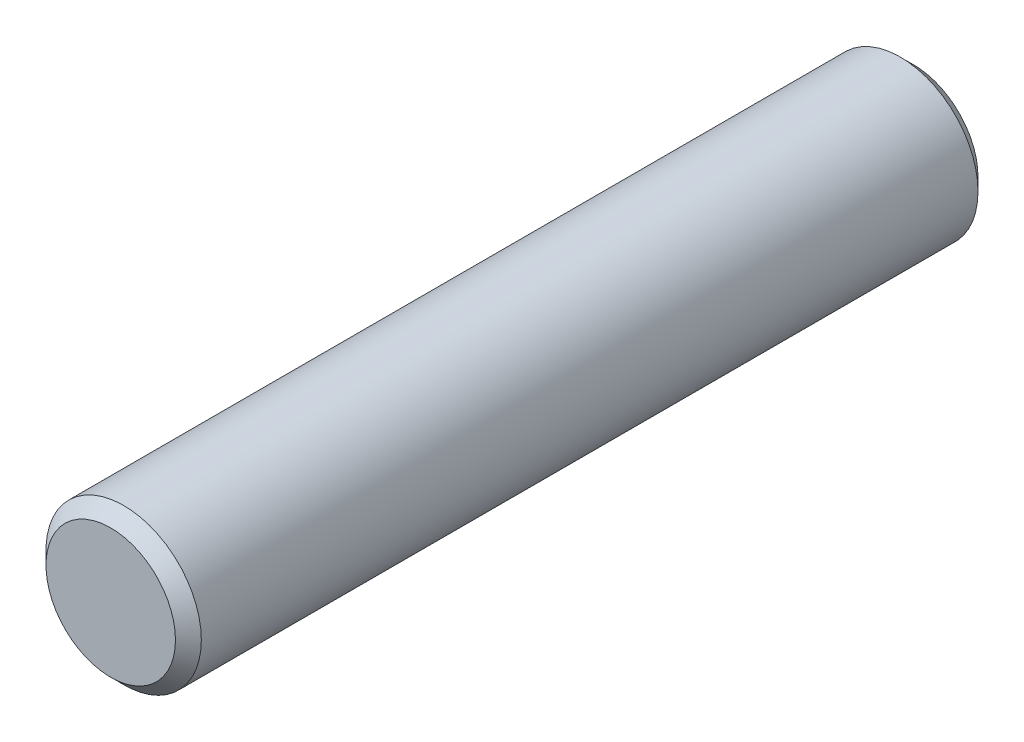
ISO-10303-21;
HEADER;
FILE_DESCRIPTION(('STEP AP214'),'2;1');
FILE_NAME('part.step','',(''),(''),'','','');
FILE_SCHEMA(('AUTOMOTIVE_DESIGN { 1 0 10303 214 1 1 1 1 }'));
ENDSEC;
DATA;
#1=APPLICATION_CONTEXT('core data for automotive mechanical design processes');
#2=APPLICATION_PROTOCOL_DEFINITION('international standard','automotive_design',2000,#1);
#3=PRODUCT_CONTEXT('',#1,'mechanical');
#4=PRODUCT('Part','Part','',(#3));
#5=PRODUCT_RELATED_PRODUCT_CATEGORY('part','',(#4));
#6=PRODUCT_DEFINITION_FORMATION('','',#4);
#7=PRODUCT_DEFINITION_CONTEXT('part definition',#1,'design');
#8=PRODUCT_DEFINITION('design','',#6,#7);
#9=PRODUCT_DEFINITION_SHAPE('','',#8);
#10=(LENGTH_UNIT() NAMED_UNIT(*) SI_UNIT(.MILLI.,.METRE.));
#11=(NAMED_UNIT(*) PLANE_ANGLE_UNIT() SI_UNIT($,.RADIAN.));
#12=(NAMED_UNIT(*) SI_UNIT($,.STERADIAN.) SOLID_ANGLE_UNIT());
#13=UNCERTAINTY_MEASURE_WITH_UNIT(LENGTH_MEASURE(1.E-05),#10,'distance_accuracy_value','');
#14=(GEOMETRIC_REPRESENTATION_CONTEXT(3) GLOBAL_UNCERTAINTY_ASSIGNED_CONTEXT((#13)) GLOBAL_UNIT_ASSIGNED_CONTEXT((#10,
#11,#12)) REPRESENTATION_CONTEXT('',''));
#15=CARTESIAN_POINT('',(0.,0.,0.));
#16=DIRECTION('',(0.,0.,1.));
#17=DIRECTION('',(1.,0.,0.));
#18=AXIS2_PLACEMENT_3D('',#15,#16,#17);
#19=CARTESIAN_POINT('',(0.,0.,31.));
#20=DIRECTION('',(0.,0.,-1.));
#21=DIRECTION('',(-1.,0.,0.));
#22=AXIS2_PLACEMENT_3D('',#19,#20,#21);
#23=CYLINDRICAL_SURFACE('',#22,3.);
#24=CARTESIAN_POINT('',(0.,0.,0.5));
#25=DIRECTION('',(0.,0.,1.));
#26=DIRECTION('',(1.,0.,0.));
#27=AXIS2_PLACEMENT_3D('',#24,#25,#26);
#28=CIRCLE('',#27,3.);
#29=CARTESIAN_POINT('',(3.,0.,0.5));
#30=VERTEX_POINT('',#29);
#31=EDGE_CURVE('E360',#30,#30,#28,.T.);
#32=ORIENTED_EDGE('',*,*,#31,.T.);
#33=EDGE_LOOP('',(#32));
#34=FACE_BOUND('',#33,.T.);
#35=CARTESIAN_POINT('',(0.,0.,30.5));
#36=DIRECTION('',(0.,0.,1.));
#37=DIRECTION('',(1.,0.,0.));
#38=AXIS2_PLACEMENT_3D('',#35,#36,#37);
#39=CIRCLE('',#38,3.);
#40=CARTESIAN_POINT('',(3.,0.,30.5));
#41=VERTEX_POINT('',#40);
#42=EDGE_CURVE('E364',#41,#41,#39,.F.);
#43=ORIENTED_EDGE('',*,*,#42,.T.);
#44=EDGE_LOOP('',(#43));
#45=FACE_BOUND('',#44,.T.);
#46=ADVANCED_FACE('F350',(#34,#45),#23,.T.);
#47=CARTESIAN_POINT('',(0.,0.,31.));
#48=DIRECTION('',(0.,0.,1.));
#49=DIRECTION('',(1.,0.,0.));
#50=AXIS2_PLACEMENT_3D('',#47,#48,#49);
#51=PLANE('',#50);
#52=CARTESIAN_POINT('',(0.,0.,31.));
#53=DIRECTION('',(0.,0.,1.));
#54=DIRECTION('',(1.,0.,0.));
#55=AXIS2_PLACEMENT_3D('',#52,#53,#54);
#56=CIRCLE('',#55,2.5);
#57=CARTESIAN_POINT('',(2.5,0.,31.));
#58=VERTEX_POINT('',#57);
#59=EDGE_CURVE('E10',#58,#58,#56,.T.);
#60=ORIENTED_EDGE('',*,*,#59,.T.);
#61=EDGE_LOOP('',(#60));
#62=FACE_BOUND('',#61,.T.);
#63=ADVANCED_FACE('F383',(#62),#51,.T.);
#64=CARTESIAN_POINT('',(0.,0.,0.));
#65=DIRECTION('',(0.,0.,1.));
#66=DIRECTION('',(1.,0.,0.));
#67=AXIS2_PLACEMENT_3D('',#64,#65,#66);
#68=PLANE('',#67);
#69=CARTESIAN_POINT('',(0.,0.,0.));
#70=DIRECTION('',(0.,0.,1.));
#71=DIRECTION('',(1.,0.,0.));
#72=AXIS2_PLACEMENT_3D('',#69,#70,#71);
#73=CIRCLE('',#72,2.5);
#74=CARTESIAN_POINT('',(2.5,0.,0.));
#75=VERTEX_POINT('',#74);
#76=EDGE_CURVE('E356',#75,#75,#73,.F.);
#77=ORIENTED_EDGE('',*,*,#76,.T.);
#78=EDGE_LOOP('',(#77));
#79=FACE_BOUND('',#78,.T.);
#80=ADVANCED_FACE('F379',(#79),#68,.F.);
#81=CARTESIAN_POINT('',(0.,0.,0.5));
#82=DIRECTION('',(0.,0.,1.));
#83=DIRECTION('',(1.,0.,0.));
#84=AXIS2_PLACEMENT_3D('',#81,#82,#83);
#85=CONICAL_SURFACE('',#84,3.,0.78539816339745);
#86=ORIENTED_EDGE('',*,*,#76,.F.);
#87=EDGE_LOOP('',(#86));
#88=FACE_BOUND('',#87,.T.);
#89=ORIENTED_EDGE('',*,*,#31,.F.);
#90=EDGE_LOOP('',(#89));
#91=FACE_BOUND('',#90,.T.);
#92=ADVANCED_FACE('F374',(#88,#91),#85,.T.);
#93=CARTESIAN_POINT('',(0.,0.,31.));
#94=DIRECTION('',(0.,0.,-1.));
#95=DIRECTION('',(-1.,0.,0.));
#96=AXIS2_PLACEMENT_3D('',#93,#94,#95);
#97=CONICAL_SURFACE('',#96,2.5,0.785398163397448);
#98=ORIENTED_EDGE('',*,*,#42,.F.);
#99=EDGE_LOOP('',(#98));
#100=FACE_BOUND('',#99,.T.);
#101=ORIENTED_EDGE('',*,*,#59,.F.);
#102=EDGE_LOOP('',(#101));
#103=FACE_BOUND('',#102,.T.);
#104=ADVANCED_FACE('F371',(#100,#103),#97,.T.);
#105=CLOSED_SHELL('',(#46,#63,#80,#92,#104));
#106=MANIFOLD_SOLID_BREP('B2',#105);
#107=ADVANCED_BREP_SHAPE_REPRESENTATION('',(#18,#106),#14);
#108=SHAPE_DEFINITION_REPRESENTATION(#9,#107);
ENDSEC;
END-ISO-10303-21;
